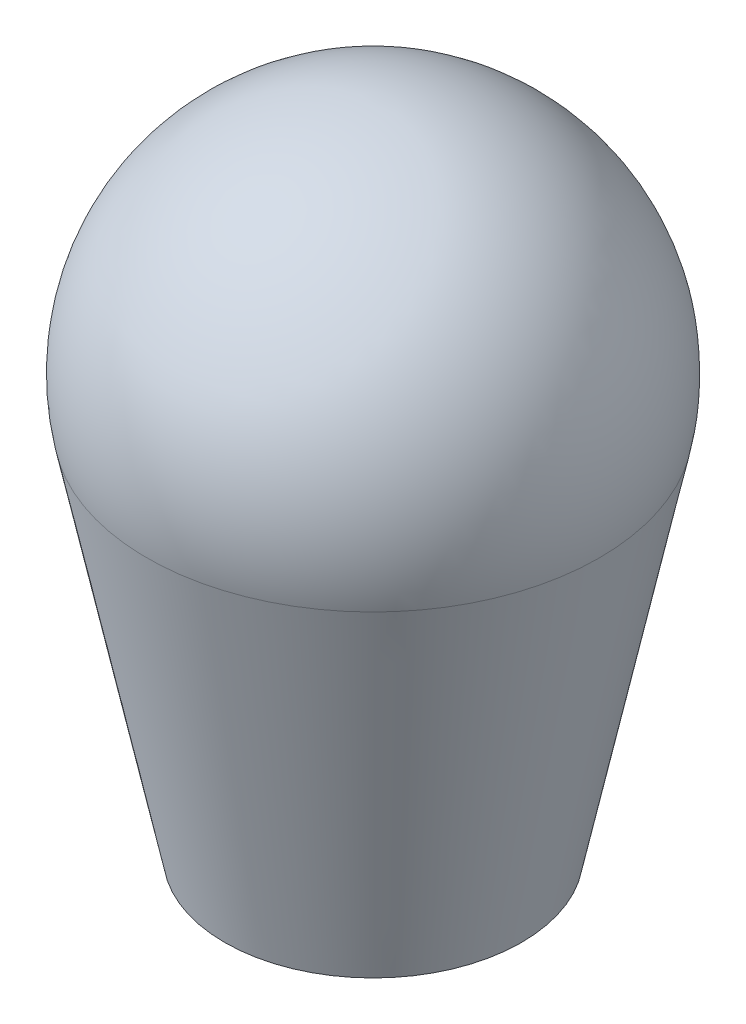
ISO-10303-21;
HEADER;
FILE_DESCRIPTION(('STEP AP214'),'2;1');
FILE_NAME('part.step','',(''),(''),'','','');
FILE_SCHEMA(('AUTOMOTIVE_DESIGN { 1 0 10303 214 1 1 1 1 }'));
ENDSEC;
DATA;
#1=APPLICATION_CONTEXT('core data for automotive mechanical design processes');
#2=APPLICATION_PROTOCOL_DEFINITION('international standard','automotive_design',2000,#1);
#3=PRODUCT_CONTEXT('',#1,'mechanical');
#4=PRODUCT('Part','Part','',(#3));
#5=PRODUCT_RELATED_PRODUCT_CATEGORY('part','',(#4));
#6=PRODUCT_DEFINITION_FORMATION('','',#4);
#7=PRODUCT_DEFINITION_CONTEXT('part definition',#1,'design');
#8=PRODUCT_DEFINITION('design','',#6,#7);
#9=PRODUCT_DEFINITION_SHAPE('','',#8);
#10=(LENGTH_UNIT() NAMED_UNIT(*) SI_UNIT(.MILLI.,.METRE.));
#11=(NAMED_UNIT(*) PLANE_ANGLE_UNIT() SI_UNIT($,.RADIAN.));
#12=(NAMED_UNIT(*) SI_UNIT($,.STERADIAN.) SOLID_ANGLE_UNIT());
#13=UNCERTAINTY_MEASURE_WITH_UNIT(LENGTH_MEASURE(1.E-05),#10,'distance_accuracy_value','');
#14=(GEOMETRIC_REPRESENTATION_CONTEXT(3) GLOBAL_UNCERTAINTY_ASSIGNED_CONTEXT((#13)) GLOBAL_UNIT_ASSIGNED_CONTEXT((#10,
#11,#12)) REPRESENTATION_CONTEXT('',''));
#15=CARTESIAN_POINT('',(0.,0.,0.));
#16=DIRECTION('',(0.,0.,1.));
#17=DIRECTION('',(1.,0.,0.));
#18=AXIS2_PLACEMENT_3D('',#15,#16,#17);
#19=CARTESIAN_POINT('',(0.,170.511178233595,0.));
#20=DIRECTION('',(0.,-1.,0.));
#21=DIRECTION('',(1.,0.,0.));
#22=AXIS2_PLACEMENT_3D('',#19,#20,#21);
#23=SPHERICAL_SURFACE('',#22,93.988821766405);
#24=CARTESIAN_POINT('',(34.6867215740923,154.661701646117,-75.8160926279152));
#25=DIRECTION('',(-0.408717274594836,0.186756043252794,0.893348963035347));
#26=DIRECTION('',(0.909347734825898,0.,0.416036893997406));
#27=AXIS2_PLACEMENT_3D('',#24,#25,#26);
#28=CIRCLE('',#27,40.3911395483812);
#29=CARTESIAN_POINT('',(0.,164.867690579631,-93.8192393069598));
#30=VERTEX_POINT('',#29);
#31=CARTESIAN_POINT('',(71.0149827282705,151.278429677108,-58.4882229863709));
#32=VERTEX_POINT('',#31);
#33=EDGE_CURVE('E387',#30,#32,#28,.F.);
#34=ORIENTED_EDGE('',*,*,#33,.F.);
#35=CARTESIAN_POINT('',(-34.6867215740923,154.661701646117,-75.8160926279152));
#36=DIRECTION('',(0.408717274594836,0.186756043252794,0.893348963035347));
#37=DIRECTION('',(0.909347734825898,0.,-0.416036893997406));
#38=AXIS2_PLACEMENT_3D('',#35,#36,#37);
#39=CIRCLE('',#38,40.3911395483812);
#40=CARTESIAN_POINT('',(-71.0149827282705,151.278429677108,-58.4882229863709));
#41=VERTEX_POINT('',#40);
#42=EDGE_CURVE('E411',#41,#30,#39,.F.);
#43=ORIENTED_EDGE('',*,*,#42,.F.);
#44=CARTESIAN_POINT('',(0.,151.278429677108,0.));
#45=DIRECTION('',(0.,-1.,0.));
#46=DIRECTION('',(1.,0.,0.));
#47=AXIS2_PLACEMENT_3D('',#44,#45,#46);
#48=CIRCLE('',#47,92.);
#49=EDGE_CURVE('E416',#32,#41,#48,.T.);
#50=ORIENTED_EDGE('',*,*,#49,.F.);
#51=EDGE_LOOP('',(#34,#43,#50));
#52=FACE_BOUND('',#51,.T.);
#53=ADVANCED_FACE('F206',(#52),#23,.T.);
#54=CARTESIAN_POINT('',(0.,0.,0.));
#55=DIRECTION('',(0.,1.,0.));
#56=DIRECTION('',(-1.,0.,0.));
#57=AXIS2_PLACEMENT_3D('',#54,#55,#56);
#58=CONICAL_SURFACE('',#57,60.375,0.206083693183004);
#59=CARTESIAN_POINT('',(71.0150143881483,151.278629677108,-58.4882503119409));
#60=CARTESIAN_POINT('',(69.0193870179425,138.67199241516,-56.7658345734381));
#61=CARTESIAN_POINT('',(67.0236446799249,126.06536585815,-55.0434736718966));
#62=CARTESIAN_POINT('',(63.0318379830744,100.852142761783,-51.5989054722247));
#63=CARTESIAN_POINT('',(61.035773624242,88.2455462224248,-49.876698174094));
#64=CARTESIAN_POINT('',(57.0432307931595,63.0323917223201,-46.4324811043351));
#65=CARTESIAN_POINT('',(55.0467523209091,50.4258337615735,-44.7104713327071));
#66=CARTESIAN_POINT('',(51.0532124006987,25.2127721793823,-41.2667298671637));
#67=CARTESIAN_POINT('',(49.0561509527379,12.6062685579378,-39.5449981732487));
#68=CARTESIAN_POINT('',(47.0587135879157,-0.00020000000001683,-37.8234457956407));
#69=B_SPLINE_CURVE_WITH_KNOTS('',3,(#59,#60,#61,#62,#63,#64,#65,#66,#67,#68),.UNSPECIFIED.,.F.,
.F.,(4,2,2,2,4),(0.,38.6379208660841,77.2758416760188,115.913762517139,154.55168341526),.UNSPECIFIED.);
#70=CARTESIAN_POINT('',(47.0587452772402,0.,-37.8234731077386));
#71=VERTEX_POINT('',#70);
#72=EDGE_CURVE('E381',#32,#71,#69,.T.);
#73=ORIENTED_EDGE('',*,*,#72,.F.);
#74=ORIENTED_EDGE('',*,*,#49,.T.);
#75=CARTESIAN_POINT('',(-47.0587135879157,-0.000199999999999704,-37.8234457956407));
#76=CARTESIAN_POINT('',(-49.6496715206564,16.3522795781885,-40.0565654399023));
#77=CARTESIAN_POINT('',(-52.2400225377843,32.7048157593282,-42.2899745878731));
#78=CARTESIAN_POINT('',(-57.4198266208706,65.4099718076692,-46.7572212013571));
#79=CARTESIAN_POINT('',(-60.0092796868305,81.7625916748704,-48.9910586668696));
#80=CARTESIAN_POINT('',(-64.0013584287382,106.975789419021,-52.435497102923));
#81=CARTESIAN_POINT('',(-65.4041896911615,115.836348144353,-53.6460000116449));
#82=CARTESIAN_POINT('',(-68.2097057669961,133.557479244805,-56.0670756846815));
#83=CARTESIAN_POINT('',(-69.6123905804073,142.418051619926,-57.2776484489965));
#84=CARTESIAN_POINT('',(-71.0150143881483,151.278629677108,-58.4882503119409));
#85=B_SPLINE_CURVE_WITH_KNOTS('',3,(#75,#76,#77,#78,#79,#80,#81,#82,#83,#84),.UNSPECIFIED.,.F.,
.F.,(4,2,2,2,4),(0.,50.1191706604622,100.23834123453,127.395012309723,154.55168340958),.UNSPECIFIED.);
#86=CARTESIAN_POINT('',(-47.0587452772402,0.,-37.8234731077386));
#87=VERTEX_POINT('',#86);
#88=EDGE_CURVE('E405',#87,#41,#85,.T.);
#89=ORIENTED_EDGE('',*,*,#88,.F.);
#90=CARTESIAN_POINT('',(0.,0.,0.));
#91=DIRECTION('',(0.,-1.,0.));
#92=DIRECTION('',(1.,0.,0.));
#93=AXIS2_PLACEMENT_3D('',#90,#91,#92);
#94=CIRCLE('',#93,60.375);
#95=EDGE_CURVE('E414',#71,#87,#94,.T.);
#96=ORIENTED_EDGE('',*,*,#95,.F.);
#97=EDGE_LOOP('',(#73,#74,#89,#96));
#98=FACE_BOUND('',#97,.T.);
#99=ADVANCED_FACE('F389',(#98),#58,.T.);
#100=CARTESIAN_POINT('',(60.375,0.,0.));
#101=DIRECTION('',(0.,-1.,0.));
#102=DIRECTION('',(1.,0.,0.));
#103=AXIS2_PLACEMENT_3D('',#100,#101,#102);
#104=PLANE('',#103);
#105=CARTESIAN_POINT('',(0.,0.,0.));
#106=DIRECTION('',(0.,1.,0.));
#107=DIRECTION('',(-1.,0.,0.));
#108=AXIS2_PLACEMENT_3D('',#105,#106,#107);
#109=CIRCLE('',#108,46.);
#110=CARTESIAN_POINT('',(-46.,0.,0.));
#111=VERTEX_POINT('',#110);
#112=EDGE_CURVE('E375',#111,#111,#109,.T.);
#113=ORIENTED_EDGE('',*,*,#112,.T.);
#114=EDGE_LOOP('',(#113));
#115=FACE_BOUND('',#114,.T.);
#116=DIRECTION('',(-0.909347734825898,0.,-0.416036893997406));
#117=VECTOR('',#116,1.);
#118=CARTESIAN_POINT('',(72.37959328,0.,-26.2388981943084));
#119=LINE('',#118,#117);
#120=CARTESIAN_POINT('',(0.,0.,-59.3533823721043));
#121=VERTEX_POINT('',#120);
#122=EDGE_CURVE('E379',#71,#121,#119,.T.);
#123=ORIENTED_EDGE('',*,*,#122,.F.);
#124=ORIENTED_EDGE('',*,*,#95,.T.);
#125=DIRECTION('',(-0.909347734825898,0.,0.416036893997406));
#126=VECTOR('',#125,1.);
#127=CARTESIAN_POINT('',(27.4701880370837,0.,-71.921304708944));
#128=LINE('',#127,#126);
#129=EDGE_CURVE('E213',#121,#87,#128,.T.);
#130=ORIENTED_EDGE('',*,*,#129,.F.);
#131=EDGE_LOOP('',(#123,#124,#130));
#132=FACE_BOUND('',#131,.T.);
#133=ADVANCED_FACE('F403',(#115,#132),#104,.T.);
#134=CARTESIAN_POINT('',(-21.671531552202,-9.90241845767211,-47.3682945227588));
#135=DIRECTION('',(0.408717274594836,0.186756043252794,0.893348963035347));
#136=DIRECTION('',(0.909347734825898,0.,-0.416036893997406));
#137=AXIS2_PLACEMENT_3D('',#134,#135,#136);
#138=PLANE('',#137);
#139=DIRECTION('',(-0.835009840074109,0.471618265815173,0.283433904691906));
#140=VECTOR('',#139,1.);
#141=CARTESIAN_POINT('',(-9.42013058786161,148.710114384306,-86.1316554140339));
#142=LINE('',#141,#140);
#143=CARTESIAN_POINT('',(-9.42013058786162,148.710114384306,-86.1316554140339));
#144=VERTEX_POINT('',#143);
#145=CARTESIAN_POINT('',(-49.1935085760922,171.174342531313,-72.6310674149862));
#146=VERTEX_POINT('',#145);
#147=EDGE_CURVE('E303',#144,#146,#142,.T.);
#148=ORIENTED_EDGE('',*,*,#147,.T.);
#149=DIRECTION('',(-0.368386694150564,-0.861799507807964,0.34870166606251));
#150=VECTOR('',#149,1.);
#151=CARTESIAN_POINT('',(-49.1935085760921,171.174342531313,-72.6310674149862));
#152=LINE('',#151,#150);
#153=CARTESIAN_POINT('',(-62.3442879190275,140.409563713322,-60.1830101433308));
#154=VERTEX_POINT('',#153);
#155=EDGE_CURVE('E220',#146,#154,#152,.T.);
#156=ORIENTED_EDGE('',*,*,#155,.T.);
#157=DIRECTION('',(0.91266104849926,-0.0836350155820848,-0.400068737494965));
#158=VECTOR('',#157,1.);
#159=CARTESIAN_POINT('',(-62.3442879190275,140.409563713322,-60.1830101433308));
#160=LINE('',#159,#158);
#161=CARTESIAN_POINT('',(-9.42013058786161,135.559666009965,-83.3825329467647));
#162=VERTEX_POINT('',#161);
#163=EDGE_CURVE('E332',#154,#162,#160,.T.);
#164=ORIENTED_EDGE('',*,*,#163,.T.);
#165=DIRECTION('',(0.,0.978839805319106,-0.204628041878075));
#166=VECTOR('',#165,1.);
#167=CARTESIAN_POINT('',(-9.42013058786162,135.559666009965,-83.3825329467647));
#168=LINE('',#167,#166);
#169=EDGE_CURVE('E326',#162,#144,#168,.T.);
#170=ORIENTED_EDGE('',*,*,#169,.T.);
#171=EDGE_LOOP('',(#148,#156,#164,#170));
#172=FACE_BOUND('',#171,.T.);
#173=ORIENTED_EDGE('',*,*,#42,.T.);
#174=DIRECTION('',(0.,-0.978839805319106,0.204628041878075));
#175=VECTOR('',#174,1.);
#176=CARTESIAN_POINT('',(0.,-11.8883680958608,-56.8680998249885));
#177=LINE('',#176,#175);
#178=EDGE_CURVE('E13',#30,#121,#177,.T.);
#179=ORIENTED_EDGE('',*,*,#178,.T.);
#180=ORIENTED_EDGE('',*,*,#129,.T.);
#181=ORIENTED_EDGE('',*,*,#88,.T.);
#182=EDGE_LOOP('',(#173,#179,#180,#181));
#183=FACE_BOUND('',#182,.T.);
#184=ADVANCED_FACE('F398',(#172,#183),#138,.F.);
#185=CARTESIAN_POINT('',(21.671531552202,-9.90241845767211,-47.3682945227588));
#186=DIRECTION('',(-0.408717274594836,0.186756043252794,0.893348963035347));
#187=DIRECTION('',(-0.909347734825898,0.,-0.416036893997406));
#188=AXIS2_PLACEMENT_3D('',#185,#186,#187);
#189=PLANE('',#188);
#190=DIRECTION('',(-0.91266104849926,-0.0836350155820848,-0.400068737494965));
#191=VECTOR('',#190,1.);
#192=CARTESIAN_POINT('',(62.3442879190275,140.409563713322,-60.1830101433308));
#193=LINE('',#192,#191);
#194=CARTESIAN_POINT('',(62.3442879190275,140.409563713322,-60.1830101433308));
#195=VERTEX_POINT('',#194);
#196=CARTESIAN_POINT('',(9.42013058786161,135.559666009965,-83.3825329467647));
#197=VERTEX_POINT('',#196);
#198=EDGE_CURVE('E343',#195,#197,#193,.T.);
#199=ORIENTED_EDGE('',*,*,#198,.F.);
#200=DIRECTION('',(0.368386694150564,-0.861799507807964,0.34870166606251));
#201=VECTOR('',#200,1.);
#202=CARTESIAN_POINT('',(49.1935085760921,171.174342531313,-72.6310674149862));
#203=LINE('',#202,#201);
#204=CARTESIAN_POINT('',(49.1935085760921,171.174342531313,-72.6310674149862));
#205=VERTEX_POINT('',#204);
#206=EDGE_CURVE('E359',#205,#195,#203,.T.);
#207=ORIENTED_EDGE('',*,*,#206,.F.);
#208=DIRECTION('',(0.835009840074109,0.471618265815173,0.283433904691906));
#209=VECTOR('',#208,1.);
#210=CARTESIAN_POINT('',(9.42013058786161,148.710114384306,-86.1316554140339));
#211=LINE('',#210,#209);
#212=CARTESIAN_POINT('',(9.42013058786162,148.710114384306,-86.1316554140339));
#213=VERTEX_POINT('',#212);
#214=EDGE_CURVE('E363',#213,#205,#211,.T.);
#215=ORIENTED_EDGE('',*,*,#214,.F.);
#216=DIRECTION('',(0.,0.978839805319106,-0.204628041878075));
#217=VECTOR('',#216,1.);
#218=CARTESIAN_POINT('',(9.42013058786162,135.559666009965,-83.3825329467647));
#219=LINE('',#218,#217);
#220=EDGE_CURVE('E228',#197,#213,#219,.T.);
#221=ORIENTED_EDGE('',*,*,#220,.F.);
#222=EDGE_LOOP('',(#199,#207,#215,#221));
#223=FACE_BOUND('',#222,.T.);
#224=ORIENTED_EDGE('',*,*,#178,.F.);
#225=ORIENTED_EDGE('',*,*,#33,.T.);
#226=ORIENTED_EDGE('',*,*,#72,.T.);
#227=ORIENTED_EDGE('',*,*,#122,.T.);
#228=EDGE_LOOP('',(#224,#225,#226,#227));
#229=FACE_BOUND('',#228,.T.);
#230=ADVANCED_FACE('F392',(#223,#229),#189,.F.);
#231=CARTESIAN_POINT('',(0.,-23.7078573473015,0.));
#232=DIRECTION('',(0.,1.,0.));
#233=DIRECTION('',(1.,0.,0.));
#234=AXIS2_PLACEMENT_3D('',#231,#232,#233);
#235=SPHERICAL_SURFACE('',#234,51.75);
#236=ORIENTED_EDGE('',*,*,#112,.F.);
#237=EDGE_LOOP('',(#236));
#238=FACE_BOUND('',#237,.T.);
#239=ADVANCED_FACE('F397',(#238),#235,.F.);
#240=CARTESIAN_POINT('',(49.1935085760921,171.174342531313,-72.6310674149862));
#241=DIRECTION('',(-0.835009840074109,-0.471618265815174,-0.283433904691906));
#242=DIRECTION('',(0.368386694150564,-0.861799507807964,0.34870166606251));
#243=AXIS2_PLACEMENT_3D('',#240,#241,#242);
#244=PLANE('',#243);
#245=DIRECTION('',(0.408717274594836,-0.186756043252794,-0.893348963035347));
#246=VECTOR('',#245,1.);
#247=CARTESIAN_POINT('',(49.1935085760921,171.174342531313,-72.6310674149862));
#248=LINE('',#247,#246);
#249=CARTESIAN_POINT('',(50.4392788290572,170.605110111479,-75.353995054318));
#250=VERTEX_POINT('',#249);
#251=EDGE_CURVE('E373',#205,#250,#248,.T.);
#252=ORIENTED_EDGE('',*,*,#251,.F.);
#253=ORIENTED_EDGE('',*,*,#206,.T.);
#254=DIRECTION('',(0.408717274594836,-0.186756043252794,-0.893348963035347));
#255=VECTOR('',#254,1.);
#256=CARTESIAN_POINT('',(62.3442879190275,140.409563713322,-60.1830101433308));
#257=LINE('',#256,#255);
#258=CARTESIAN_POINT('',(63.5900581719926,139.840331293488,-62.9059377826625));
#259=VERTEX_POINT('',#258);
#260=EDGE_CURVE('E371',#195,#259,#257,.T.);
#261=ORIENTED_EDGE('',*,*,#260,.T.);
#262=DIRECTION('',(0.368386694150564,-0.861799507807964,0.34870166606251));
#263=VECTOR('',#262,1.);
#264=CARTESIAN_POINT('',(50.4392788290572,170.605110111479,-75.3539950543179));
#265=LINE('',#264,#263);
#266=EDGE_CURVE('E349',#250,#259,#265,.T.);
#267=ORIENTED_EDGE('',*,*,#266,.F.);
#268=EDGE_LOOP('',(#252,#253,#261,#267));
#269=FACE_BOUND('',#268,.T.);
#270=ADVANCED_FACE('F457',(#269),#244,.F.);
#271=CARTESIAN_POINT('',(62.3442879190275,140.409563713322,-60.1830101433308));
#272=DIRECTION('',(0.,0.978839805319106,-0.204628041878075));
#273=DIRECTION('',(-0.91266104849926,-0.0836350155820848,-0.400068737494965));
#274=AXIS2_PLACEMENT_3D('',#271,#272,#273);
#275=PLANE('',#274);
#276=ORIENTED_EDGE('',*,*,#260,.F.);
#277=ORIENTED_EDGE('',*,*,#198,.T.);
#278=DIRECTION('',(0.408717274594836,-0.186756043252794,-0.893348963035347));
#279=VECTOR('',#278,1.);
#280=CARTESIAN_POINT('',(9.42013058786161,135.559666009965,-83.3825329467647));
#281=LINE('',#280,#279);
#282=CARTESIAN_POINT('',(10.6659008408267,134.99043359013,-86.1054605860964));
#283=VERTEX_POINT('',#282);
#284=EDGE_CURVE('E369',#197,#283,#281,.T.);
#285=ORIENTED_EDGE('',*,*,#284,.T.);
#286=DIRECTION('',(-0.91266104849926,-0.0836350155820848,-0.400068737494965));
#287=VECTOR('',#286,1.);
#288=CARTESIAN_POINT('',(63.5900581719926,139.840331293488,-62.9059377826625));
#289=LINE('',#288,#287);
#290=EDGE_CURVE('E344',#259,#283,#289,.T.);
#291=ORIENTED_EDGE('',*,*,#290,.F.);
#292=EDGE_LOOP('',(#276,#277,#285,#291));
#293=FACE_BOUND('',#292,.T.);
#294=ADVANCED_FACE('F472',(#293),#275,.F.);
#295=CARTESIAN_POINT('',(9.42013058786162,135.559666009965,-83.3825329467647));
#296=DIRECTION('',(0.91266104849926,0.0836350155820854,0.400068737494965));
#297=DIRECTION('',(0.,0.978839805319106,-0.204628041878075));
#298=AXIS2_PLACEMENT_3D('',#295,#296,#297);
#299=PLANE('',#298);
#300=ORIENTED_EDGE('',*,*,#284,.F.);
#301=ORIENTED_EDGE('',*,*,#220,.T.);
#302=DIRECTION('',(0.408717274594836,-0.186756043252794,-0.893348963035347));
#303=VECTOR('',#302,1.);
#304=CARTESIAN_POINT('',(9.42013058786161,148.710114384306,-86.1316554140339));
#305=LINE('',#304,#303);
#306=CARTESIAN_POINT('',(10.6659008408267,148.140881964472,-88.8545830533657));
#307=VERTEX_POINT('',#306);
#308=EDGE_CURVE('E348',#213,#307,#305,.T.);
#309=ORIENTED_EDGE('',*,*,#308,.T.);
#310=DIRECTION('',(0.,0.978839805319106,-0.204628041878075));
#311=VECTOR('',#310,1.);
#312=CARTESIAN_POINT('',(10.6659008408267,134.99043359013,-86.1054605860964));
#313=LINE('',#312,#311);
#314=EDGE_CURVE('E338',#283,#307,#313,.T.);
#315=ORIENTED_EDGE('',*,*,#314,.F.);
#316=EDGE_LOOP('',(#300,#301,#309,#315));
#317=FACE_BOUND('',#316,.T.);
#318=ADVANCED_FACE('F482',(#317),#299,.F.);
#319=CARTESIAN_POINT('',(9.42013058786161,148.710114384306,-86.1316554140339));
#320=DIRECTION('',(0.368386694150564,-0.861799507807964,0.34870166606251));
#321=DIRECTION('',(0.835009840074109,0.471618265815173,0.283433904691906));
#322=AXIS2_PLACEMENT_3D('',#319,#320,#321);
#323=PLANE('',#322);
#324=ORIENTED_EDGE('',*,*,#214,.T.);
#325=ORIENTED_EDGE('',*,*,#251,.T.);
#326=DIRECTION('',(0.835009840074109,0.471618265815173,0.283433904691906));
#327=VECTOR('',#326,1.);
#328=CARTESIAN_POINT('',(10.6659008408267,148.140881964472,-88.8545830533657));
#329=LINE('',#328,#327);
#330=EDGE_CURVE('E342',#307,#250,#329,.T.);
#331=ORIENTED_EDGE('',*,*,#330,.F.);
#332=ORIENTED_EDGE('',*,*,#308,.F.);
#333=EDGE_LOOP('',(#324,#325,#331,#332));
#334=FACE_BOUND('',#333,.T.);
#335=ADVANCED_FACE('F492',(#334),#323,.F.);
#336=CARTESIAN_POINT('',(22.9173018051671,-10.4716508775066,-50.0912221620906));
#337=DIRECTION('',(-0.408717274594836,0.186756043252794,0.893348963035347));
#338=DIRECTION('',(-0.909347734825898,0.,-0.416036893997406));
#339=AXIS2_PLACEMENT_3D('',#336,#337,#338);
#340=PLANE('',#339);
#341=ORIENTED_EDGE('',*,*,#314,.T.);
#342=ORIENTED_EDGE('',*,*,#330,.T.);
#343=ORIENTED_EDGE('',*,*,#266,.T.);
#344=ORIENTED_EDGE('',*,*,#290,.T.);
#345=EDGE_LOOP('',(#341,#342,#343,#344));
#346=FACE_BOUND('',#345,.T.);
#347=ADVANCED_FACE('F501',(#346),#340,.F.);
#348=CARTESIAN_POINT('',(-49.1935085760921,171.174342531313,-72.6310674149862));
#349=DIRECTION('',(0.835009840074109,-0.471618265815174,-0.283433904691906));
#350=DIRECTION('',(-0.368386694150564,-0.861799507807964,0.34870166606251));
#351=AXIS2_PLACEMENT_3D('',#348,#349,#350);
#352=PLANE('',#351);
#353=DIRECTION('',(-0.408717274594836,-0.186756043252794,-0.893348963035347));
#354=VECTOR('',#353,1.);
#355=CARTESIAN_POINT('',(-49.1935085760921,171.174342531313,-72.6310674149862));
#356=LINE('',#355,#354);
#357=CARTESIAN_POINT('',(-50.4392788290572,170.605110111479,-75.353995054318));
#358=VERTEX_POINT('',#357);
#359=EDGE_CURVE('E308',#146,#358,#356,.T.);
#360=ORIENTED_EDGE('',*,*,#359,.T.);
#361=DIRECTION('',(-0.368386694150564,-0.861799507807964,0.34870166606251));
#362=VECTOR('',#361,1.);
#363=CARTESIAN_POINT('',(-50.4392788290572,170.605110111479,-75.3539950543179));
#364=LINE('',#363,#362);
#365=CARTESIAN_POINT('',(-63.5900581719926,139.840331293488,-62.9059377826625));
#366=VERTEX_POINT('',#365);
#367=EDGE_CURVE('E295',#358,#366,#364,.T.);
#368=ORIENTED_EDGE('',*,*,#367,.T.);
#369=DIRECTION('',(-0.408717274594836,-0.186756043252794,-0.893348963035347));
#370=VECTOR('',#369,1.);
#371=CARTESIAN_POINT('',(-62.3442879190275,140.409563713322,-60.1830101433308));
#372=LINE('',#371,#370);
#373=EDGE_CURVE('E329',#154,#366,#372,.T.);
#374=ORIENTED_EDGE('',*,*,#373,.F.);
#375=ORIENTED_EDGE('',*,*,#155,.F.);
#376=EDGE_LOOP('',(#360,#368,#374,#375));
#377=FACE_BOUND('',#376,.T.);
#378=ADVANCED_FACE('F510',(#377),#352,.F.);
#379=CARTESIAN_POINT('',(-62.3442879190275,140.409563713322,-60.1830101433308));
#380=DIRECTION('',(0.,0.978839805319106,-0.204628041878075));
#381=DIRECTION('',(0.91266104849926,-0.0836350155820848,-0.400068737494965));
#382=AXIS2_PLACEMENT_3D('',#379,#380,#381);
#383=PLANE('',#382);
#384=ORIENTED_EDGE('',*,*,#373,.T.);
#385=DIRECTION('',(0.91266104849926,-0.0836350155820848,-0.400068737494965));
#386=VECTOR('',#385,1.);
#387=CARTESIAN_POINT('',(-63.5900581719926,139.840331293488,-62.9059377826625));
#388=LINE('',#387,#386);
#389=CARTESIAN_POINT('',(-10.6659008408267,134.99043359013,-86.1054605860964));
#390=VERTEX_POINT('',#389);
#391=EDGE_CURVE('E322',#366,#390,#388,.T.);
#392=ORIENTED_EDGE('',*,*,#391,.T.);
#393=DIRECTION('',(-0.408717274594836,-0.186756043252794,-0.893348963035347));
#394=VECTOR('',#393,1.);
#395=CARTESIAN_POINT('',(-9.42013058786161,135.559666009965,-83.3825329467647));
#396=LINE('',#395,#394);
#397=EDGE_CURVE('E307',#162,#390,#396,.T.);
#398=ORIENTED_EDGE('',*,*,#397,.F.);
#399=ORIENTED_EDGE('',*,*,#163,.F.);
#400=EDGE_LOOP('',(#384,#392,#398,#399));
#401=FACE_BOUND('',#400,.T.);
#402=ADVANCED_FACE('F525',(#401),#383,.F.);
#403=CARTESIAN_POINT('',(-9.42013058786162,135.559666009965,-83.3825329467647));
#404=DIRECTION('',(-0.91266104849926,0.0836350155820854,0.400068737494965));
#405=DIRECTION('',(0.,0.978839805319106,-0.204628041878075));
#406=AXIS2_PLACEMENT_3D('',#403,#404,#405);
#407=PLANE('',#406);
#408=ORIENTED_EDGE('',*,*,#397,.T.);
#409=DIRECTION('',(0.,0.978839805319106,-0.204628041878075));
#410=VECTOR('',#409,1.);
#411=CARTESIAN_POINT('',(-10.6659008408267,134.99043359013,-86.1054605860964));
#412=LINE('',#411,#410);
#413=CARTESIAN_POINT('',(-10.6659008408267,148.140881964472,-88.8545830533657));
#414=VERTEX_POINT('',#413);
#415=EDGE_CURVE('E292',#390,#414,#412,.T.);
#416=ORIENTED_EDGE('',*,*,#415,.T.);
#417=DIRECTION('',(-0.408717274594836,-0.186756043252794,-0.893348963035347));
#418=VECTOR('',#417,1.);
#419=CARTESIAN_POINT('',(-9.42013058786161,148.710114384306,-86.1316554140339));
#420=LINE('',#419,#418);
#421=EDGE_CURVE('E300',#144,#414,#420,.T.);
#422=ORIENTED_EDGE('',*,*,#421,.F.);
#423=ORIENTED_EDGE('',*,*,#169,.F.);
#424=EDGE_LOOP('',(#408,#416,#422,#423));
#425=FACE_BOUND('',#424,.T.);
#426=ADVANCED_FACE('F310',(#425),#407,.F.);
#427=CARTESIAN_POINT('',(-9.42013058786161,148.710114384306,-86.1316554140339));
#428=DIRECTION('',(-0.368386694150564,-0.861799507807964,0.34870166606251));
#429=DIRECTION('',(-0.835009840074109,0.471618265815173,0.283433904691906));
#430=AXIS2_PLACEMENT_3D('',#427,#428,#429);
#431=PLANE('',#430);
#432=ORIENTED_EDGE('',*,*,#147,.F.);
#433=ORIENTED_EDGE('',*,*,#421,.T.);
#434=DIRECTION('',(-0.835009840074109,0.471618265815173,0.283433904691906));
#435=VECTOR('',#434,1.);
#436=CARTESIAN_POINT('',(-10.6659008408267,148.140881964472,-88.8545830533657));
#437=LINE('',#436,#435);
#438=EDGE_CURVE('E288',#414,#358,#437,.T.);
#439=ORIENTED_EDGE('',*,*,#438,.T.);
#440=ORIENTED_EDGE('',*,*,#359,.F.);
#441=EDGE_LOOP('',(#432,#433,#439,#440));
#442=FACE_BOUND('',#441,.T.);
#443=ADVANCED_FACE('F301',(#442),#431,.F.);
#444=CARTESIAN_POINT('',(-22.9173018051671,-10.4716508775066,-50.0912221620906));
#445=DIRECTION('',(0.408717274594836,0.186756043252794,0.893348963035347));
#446=DIRECTION('',(0.909347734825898,0.,-0.416036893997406));
#447=AXIS2_PLACEMENT_3D('',#444,#445,#446);
#448=PLANE('',#447);
#449=ORIENTED_EDGE('',*,*,#415,.F.);
#450=ORIENTED_EDGE('',*,*,#391,.F.);
#451=ORIENTED_EDGE('',*,*,#367,.F.);
#452=ORIENTED_EDGE('',*,*,#438,.F.);
#453=EDGE_LOOP('',(#449,#450,#451,#452));
#454=FACE_BOUND('',#453,.T.);
#455=ADVANCED_FACE('F290',(#454),#448,.F.);
#456=CLOSED_SHELL('',(#53,#99,#133,#184,#230,#239,#270,#294,#318,#335,#347,#378,#402,#426,#443,#455));
#457=MANIFOLD_SOLID_BREP('B2',#456);
#458=ADVANCED_BREP_SHAPE_REPRESENTATION('',(#18,#457),#14);
#459=SHAPE_DEFINITION_REPRESENTATION(#9,#458);
ENDSEC;
END-ISO-10303-21;
